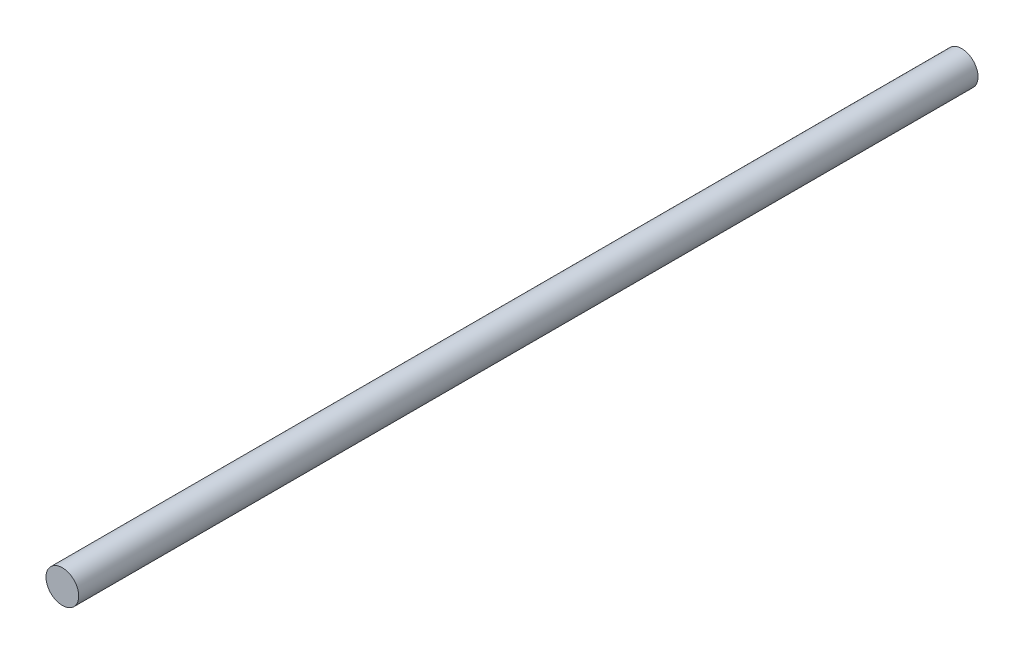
from build123d import *

# Parameters (mm, degrees)
SKETCH1_R           = 1.5
BOSS_EXTRUDE1_DEPTH = 82.4


with BuildPart() as part:
    # Sketch1 → Boss-Extrude1 (new body)
    with BuildSketch(Plane.XY):
        with Locations(Location((0, 0, 0), (0, 0, 180))):
            Circle(SKETCH1_R)
    extrude(amount=BOSS_EXTRUDE1_DEPTH)


solid = part.part
